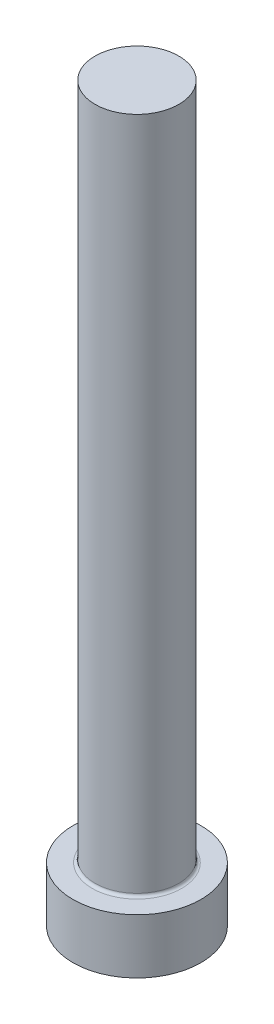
ISO-10303-21;
HEADER;
FILE_DESCRIPTION(('STEP AP214'),'2;1');
FILE_NAME('part.step','',(''),(''),'','','');
FILE_SCHEMA(('AUTOMOTIVE_DESIGN { 1 0 10303 214 1 1 1 1 }'));
ENDSEC;
DATA;
#1=APPLICATION_CONTEXT('core data for automotive mechanical design processes');
#2=APPLICATION_PROTOCOL_DEFINITION('international standard','automotive_design',2000,#1);
#3=PRODUCT_CONTEXT('',#1,'mechanical');
#4=PRODUCT('Part','Part','',(#3));
#5=PRODUCT_RELATED_PRODUCT_CATEGORY('part','',(#4));
#6=PRODUCT_DEFINITION_FORMATION('','',#4);
#7=PRODUCT_DEFINITION_CONTEXT('part definition',#1,'design');
#8=PRODUCT_DEFINITION('design','',#6,#7);
#9=PRODUCT_DEFINITION_SHAPE('','',#8);
#10=(LENGTH_UNIT() NAMED_UNIT(*) SI_UNIT(.MILLI.,.METRE.));
#11=(NAMED_UNIT(*) PLANE_ANGLE_UNIT() SI_UNIT($,.RADIAN.));
#12=(NAMED_UNIT(*) SI_UNIT($,.STERADIAN.) SOLID_ANGLE_UNIT());
#13=UNCERTAINTY_MEASURE_WITH_UNIT(LENGTH_MEASURE(1.E-05),#10,'distance_accuracy_value','');
#14=(GEOMETRIC_REPRESENTATION_CONTEXT(3) GLOBAL_UNCERTAINTY_ASSIGNED_CONTEXT((#13)) GLOBAL_UNIT_ASSIGNED_CONTEXT((#10,
#11,#12)) REPRESENTATION_CONTEXT('',''));
#15=CARTESIAN_POINT('',(0.,0.,0.));
#16=DIRECTION('',(0.,0.,1.));
#17=DIRECTION('',(1.,0.,0.));
#18=AXIS2_PLACEMENT_3D('',#15,#16,#17);
#19=CARTESIAN_POINT('',(0.,63.5,0.));
#20=DIRECTION('',(0.,-1.,0.));
#21=DIRECTION('',(0.,0.,-1.));
#22=AXIS2_PLACEMENT_3D('',#19,#20,#21);
#23=PLANE('',#22);
#24=CARTESIAN_POINT('',(0.,63.5,0.));
#25=DIRECTION('',(0.,1.,0.));
#26=DIRECTION('',(0.,0.,1.));
#27=AXIS2_PLACEMENT_3D('',#24,#25,#26);
#28=CIRCLE('',#27,3.6322);
#29=CARTESIAN_POINT('',(0.,63.5,3.6322));
#30=VERTEX_POINT('',#29);
#31=EDGE_CURVE('E10',#30,#30,#28,.T.);
#32=ORIENTED_EDGE('',*,*,#31,.T.);
#33=EDGE_LOOP('',(#32));
#34=FACE_BOUND('',#33,.T.);
#35=ADVANCED_FACE('F30',(#34),#23,.F.);
#36=CARTESIAN_POINT('',(0.,0.,0.));
#37=DIRECTION('',(0.,1.,0.));
#38=DIRECTION('',(0.,0.,1.));
#39=AXIS2_PLACEMENT_3D('',#36,#37,#38);
#40=CYLINDRICAL_SURFACE('',#39,3.6322);
#41=ORIENTED_EDGE('',*,*,#31,.F.);
#42=EDGE_LOOP('',(#41));
#43=FACE_BOUND('',#42,.T.);
#44=CARTESIAN_POINT('',(0.,5.0038,0.));
#45=DIRECTION('',(0.,1.,0.));
#46=DIRECTION('',(0.,0.,1.));
#47=AXIS2_PLACEMENT_3D('',#44,#45,#46);
#48=CIRCLE('',#47,3.6322);
#49=CARTESIAN_POINT('',(0.,5.0038,3.6322));
#50=VERTEX_POINT('',#49);
#51=EDGE_CURVE('E36',#50,#50,#48,.T.);
#52=ORIENTED_EDGE('',*,*,#51,.T.);
#53=EDGE_LOOP('',(#52));
#54=FACE_BOUND('',#53,.T.);
#55=ADVANCED_FACE('F65',(#43,#54),#40,.T.);
#56=CARTESIAN_POINT('',(0.,5.0038,0.));
#57=DIRECTION('',(0.,1.,0.));
#58=DIRECTION('',(0.,0.,1.));
#59=AXIS2_PLACEMENT_3D('',#56,#57,#58);
#60=TOROIDAL_SURFACE('',#59,3.8862,0.254);
#61=ORIENTED_EDGE('',*,*,#51,.F.);
#62=EDGE_LOOP('',(#61));
#63=FACE_BOUND('',#62,.T.);
#64=CARTESIAN_POINT('',(0.,4.7498,0.));
#65=DIRECTION('',(0.,1.,0.));
#66=DIRECTION('',(0.,0.,1.));
#67=AXIS2_PLACEMENT_3D('',#64,#65,#66);
#68=CIRCLE('',#67,3.8862);
#69=CARTESIAN_POINT('',(0.,4.7498,3.8862));
#70=VERTEX_POINT('',#69);
#71=EDGE_CURVE('E40',#70,#70,#68,.T.);
#72=ORIENTED_EDGE('',*,*,#71,.T.);
#73=EDGE_LOOP('',(#72));
#74=FACE_BOUND('',#73,.T.);
#75=ADVANCED_FACE('F69',(#63,#74),#60,.F.);
#76=CARTESIAN_POINT('',(5.5499,4.7498,0.));
#77=DIRECTION('',(0.,-1.,0.));
#78=DIRECTION('',(0.,0.,-1.));
#79=AXIS2_PLACEMENT_3D('',#76,#77,#78);
#80=PLANE('',#79);
#81=ORIENTED_EDGE('',*,*,#71,.F.);
#82=EDGE_LOOP('',(#81));
#83=FACE_BOUND('',#82,.T.);
#84=CARTESIAN_POINT('',(0.,4.7498,0.));
#85=DIRECTION('',(0.,1.,0.));
#86=DIRECTION('',(0.,0.,1.));
#87=AXIS2_PLACEMENT_3D('',#84,#85,#86);
#88=CIRCLE('',#87,5.5499);
#89=CARTESIAN_POINT('',(0.,4.7498,5.5499));
#90=VERTEX_POINT('',#89);
#91=EDGE_CURVE('E44',#90,#90,#88,.T.);
#92=ORIENTED_EDGE('',*,*,#91,.T.);
#93=EDGE_LOOP('',(#92));
#94=FACE_BOUND('',#93,.T.);
#95=ADVANCED_FACE('F61',(#83,#94),#80,.F.);
#96=CARTESIAN_POINT('',(0.,0.,0.));
#97=DIRECTION('',(0.,1.,0.));
#98=DIRECTION('',(0.,0.,1.));
#99=AXIS2_PLACEMENT_3D('',#96,#97,#98);
#100=CYLINDRICAL_SURFACE('',#99,5.5499);
#101=ORIENTED_EDGE('',*,*,#91,.F.);
#102=EDGE_LOOP('',(#101));
#103=FACE_BOUND('',#102,.T.);
#104=CARTESIAN_POINT('',(0.,0.,0.));
#105=DIRECTION('',(0.,1.,0.));
#106=DIRECTION('',(0.,0.,1.));
#107=AXIS2_PLACEMENT_3D('',#104,#105,#106);
#108=CIRCLE('',#107,5.5499);
#109=CARTESIAN_POINT('',(0.,0.,5.5499));
#110=VERTEX_POINT('',#109);
#111=EDGE_CURVE('E49',#110,#110,#108,.T.);
#112=ORIENTED_EDGE('',*,*,#111,.T.);
#113=EDGE_LOOP('',(#112));
#114=FACE_BOUND('',#113,.T.);
#115=ADVANCED_FACE('F53',(#103,#114),#100,.T.);
#116=CARTESIAN_POINT('',(0.,0.,0.));
#117=DIRECTION('',(0.,1.,0.));
#118=DIRECTION('',(0.,0.,1.));
#119=AXIS2_PLACEMENT_3D('',#116,#117,#118);
#120=PLANE('',#119);
#121=ORIENTED_EDGE('',*,*,#111,.F.);
#122=EDGE_LOOP('',(#121));
#123=FACE_BOUND('',#122,.T.);
#124=ADVANCED_FACE('F55',(#123),#120,.F.);
#125=CLOSED_SHELL('',(#35,#55,#75,#95,#115,#124));
#126=MANIFOLD_SOLID_BREP('B2',#125);
#127=ADVANCED_BREP_SHAPE_REPRESENTATION('',(#18,#126),#14);
#128=SHAPE_DEFINITION_REPRESENTATION(#9,#127);
ENDSEC;
END-ISO-10303-21;
